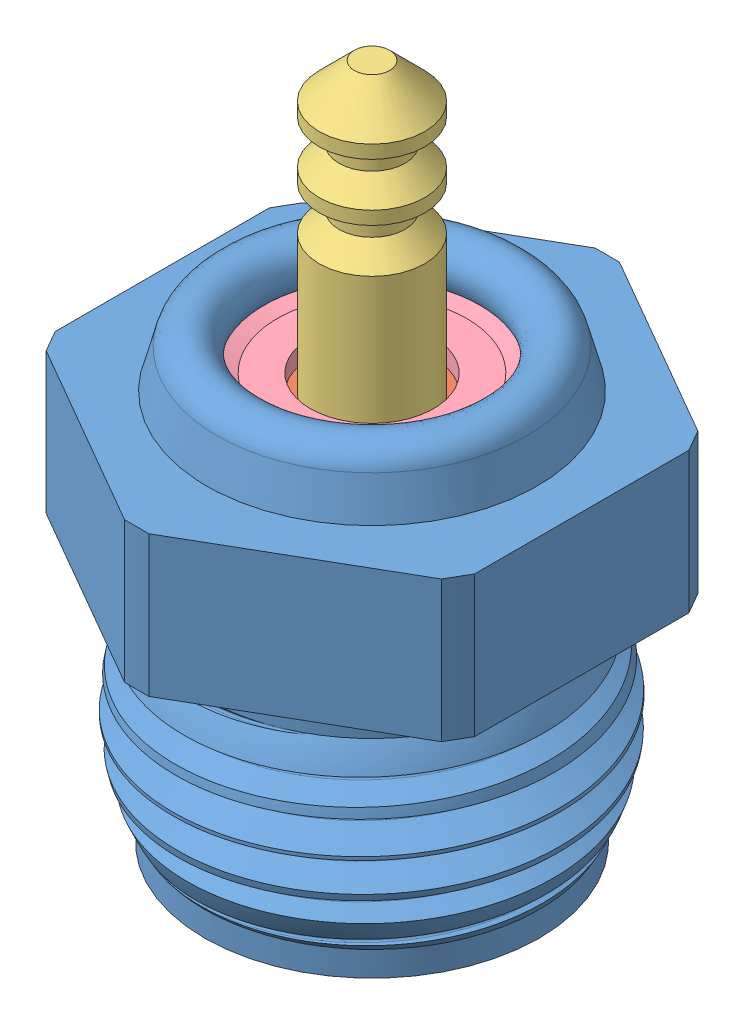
SolidWorks assembly NelsonGlowplug.SLDASM, configuration Default (file format 4100). Lengths in mm.
Overall size (9.53 16.4 10.7).
6 component instances, 5 part files, 9 mates.
Components (placement in the parent):
- GlowplugHouse-1: GlowplugHouse.SLDPRT [Default] at origin size (9.53 10.9 10.7)
- GlowplugIsolator-1: GlowplugIsolator.SLDPRT [Default] at (0 3 0) size (6 0.1 6)
- GlowplugElectrode-1: GlowplugElectrode.SLDPRT [Default] at (0 3.1 0) size (5.5 13 5.5)
- GlowplugIsolator-2: GlowplugIsolator.SLDPRT [Default] at (0 9.45 0) size (6 0.1 6)
- GlowplugSpring-1: GlowplugSpring.SLDPRT [Default] at (0 9.55 0) size (6 0.71 6)
- GlowplugElement-1: GlowplugElement.SLDPRT [Default] at (0 -0.1275 0) size (1.5 3.38 2.71)
Mates (geometry in assembly coordinates):
- Coincident1: coincident anti-aligned: plane of GlowplugHouse-1 through (1.1 3 0) normal (0 1 0); plane of GlowplugIsolator-1 through (0 3 0) normal (0 -1 0)
- Concentric1: concentric anti-aligned: cylinder of GlowplugHouse-1; cylinder of GlowplugIsolator-1
- Concentric2: concentric aligned: cylinder of GlowplugHouse-1; cylinder of GlowplugElectrode-1
- Coincident2: coincident anti-aligned: plane of GlowplugIsolator-1 through (0 3.1 0) normal (0 1 0); plane of GlowplugElectrode-1 through (0 3.1 0) normal (0 -1 0)
- Concentric3: concentric anti-aligned: cylinder of GlowplugHouse-1; cylinder of GlowplugIsolator-2
- Coincident3: coincident anti-aligned: plane of GlowplugElectrode-1 through (2.75 9.45 0) normal (0 1 0); plane of GlowplugIsolator-2
- Concentric4: concentric anti-aligned: cylinder of GlowplugHouse-1; cylinder of GlowplugSpring-1
- Coincident4: coincident anti-aligned: plane of GlowplugIsolator-2; plane of GlowplugSpring-1 through (1.4 9.55 0) normal (0 -1 0)
- Concentric5: concentric aligned: cylinder of GlowplugHouse-1; line of GlowplugElement-1 through (0 2.8725 0) axis (0 1 0)
